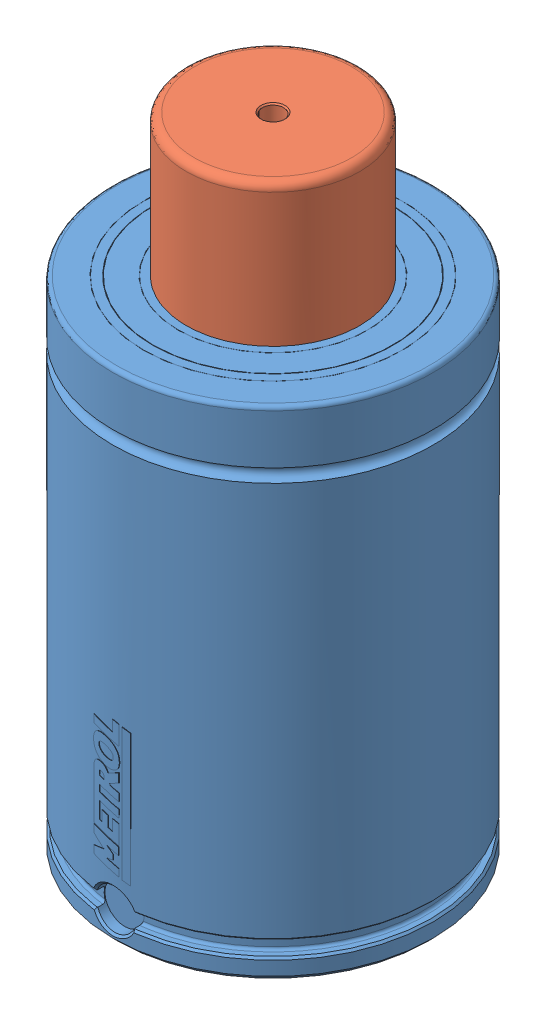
SolidWorks assembly ISNG5000-050.SLDASM, configuration Default (file format 7000). Lengths in mm.
Overall size (120 240 120.11).
2 component instances, 2 part files, 5 mates.
Components (placement in the parent):
- ISNG-5000 Body-1: ISNG-5000 Body.SLDPRT [ISNG-5000-50] x (0 0 1) z (0 -1 0) size (120.11 120 187)
- ISNG-5000 Piston-1: ISNG-5000 Piston.SLDPRT [ISNG-5000-50] at (0 162 0) x (0.417203 0 0.908814) z (0 -1 0) size (85 85 78)
Mates (geometry in assembly coordinates):
- Concentric1: concentric aligned: cylinder of ISNG-5000 Body-1 through (0 0 0) axis (0 -1 0) radius 32.5; cylinder of ISNG-5000 Piston-1 through (0 162 0) axis (0 -1 0) radius 32.5
- LimitDistance1: limit distance anti-aligned: plane of ISNG-5000 Piston-1 through (-38.6246 167 17.7311) normal (0 1 0); plane of ISNG-5000 Body-1 through (-32.5 167 0) normal (0 -1 0)
- Coincident1: coincident anti-aligned: plane of ISNG-5000 Body-1 through (0 0 0) normal (0 -1 0); plane of assembly through (0 0 0) normal (0 1 0)
- Coincident2: coincident aligned: plane of ISNG-5000 Body-1; plane of assembly through (0 0 0) normal (0 0 1)
- Coincident3: coincident anti-aligned: plane of ISNG-5000 Body-1; plane of assembly through (0 0 0) normal (1 0 0)
